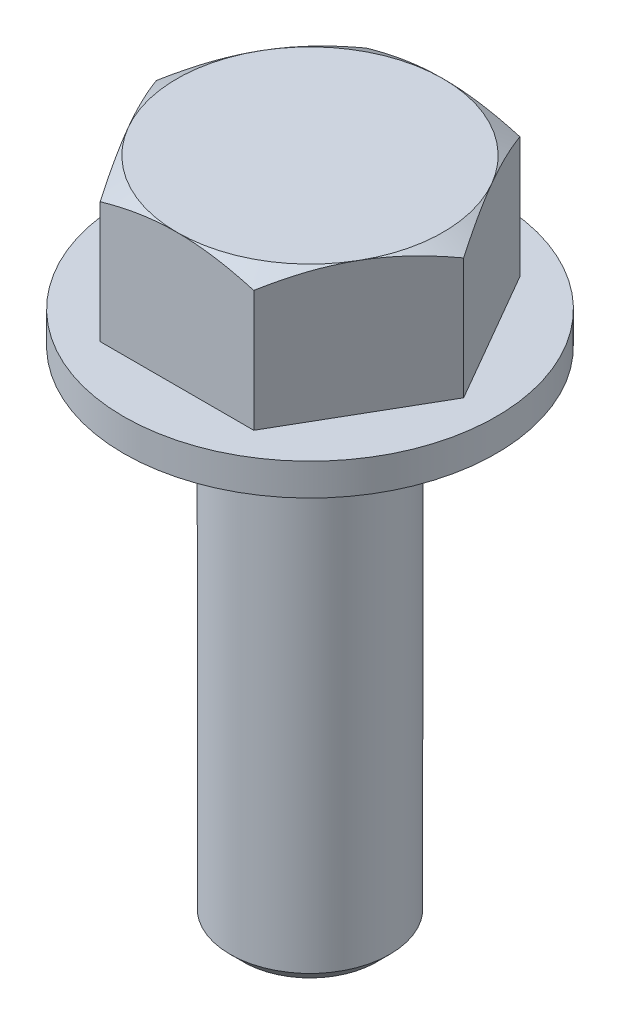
from build123d import *

# Parameters (mm, degrees)
EXTRUSION1_DEPTH = 2.5
ESQUISSE3_R      = 3
EXTRUSION2_DEPTH = 20
CHANFREIN1_SIZE  = 0.5
ESQUISSE4_W      = 3.5
ESQUISSE4_H      = 1.2


with BuildPart() as part:
    # Esquisse1 → Extrusion1 (new, symmetric)
    with BuildSketch(Plane(origin=(0, 0, 0), x_dir=(1, 0, 0), z_dir=(0, 1, 0))):
        Polygon((5.773502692, 0), (2.886751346, 5), (-2.886751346, 5), (-5.773502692, 0), (-2.886751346, -5), (2.886751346, -5), align=None)
    extrude(amount=EXTRUSION1_DEPTH, both=True)

    # Esquisse2 → Enl_vement de mati_re-R_volution4 (revolve, cut)
    with BuildSketch(Plane(origin=(0, 0, 0), x_dir=(0, 0, -1), z_dir=(1, 0, 0))):
        Polygon((2, 4.232050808), (8, 4.232050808), (8, 0.767949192), align=None)
    revolve(axis=Axis((0, 9.378046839, 0), (0, -1, 0)), mode=Mode.SUBTRACT)

    # Esquisse3 → Extrusion2 (add)
    with BuildSketch(Plane.XZ.offset(2.5)):
        with Locations(Location((0, 0, 0), (0, 0, 90))):
            Circle(ESQUISSE3_R)
    extrude(amount=EXTRUSION2_DEPTH)

    # Chanfrein1
    chanfrein1_edges = [part.edges().sort_by_distance(p)[0] for p in [
        (0, -22.5, -3),
    ]]
    chamfer(chanfrein1_edges, length=CHANFREIN1_SIZE)

    # Esquisse4 → R_volution1 (revolve)
    with BuildSketch(Plane.XY, mode=Mode.PRIVATE) as r_volution1_sk:
        with Locations((5.25, -3.1)):
            Rectangle(ESQUISSE4_W, ESQUISSE4_H)
    revolve(r_volution1_sk.sketch.rotate(Axis((0, 0, 0), (0, -1, 0)), 90), axis=Axis((0, 0, 0), (0, -1, 0)))


solid = part.part
